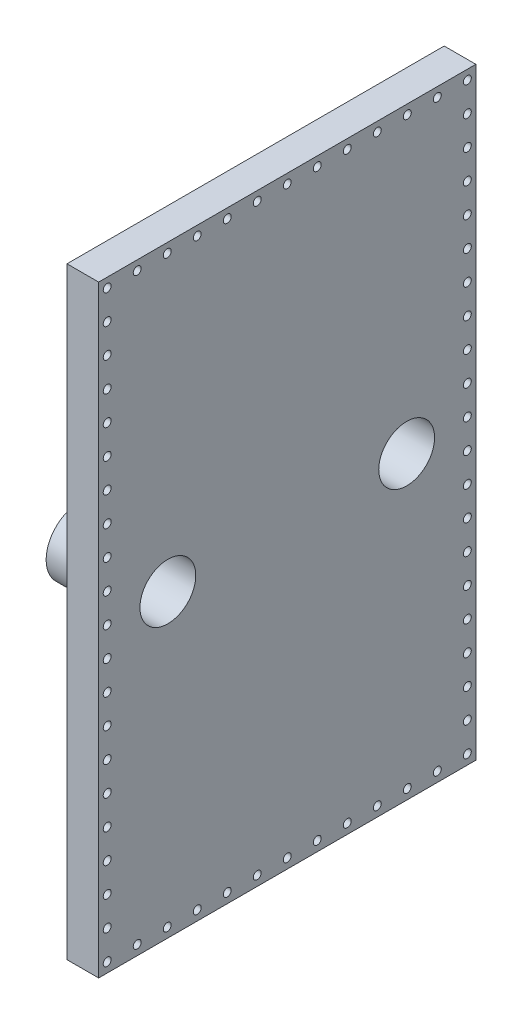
from build123d import *

# Parameters (mm, degrees)
CROQUIS1_W              = 1191.5
CROQUIS1_H              = 723
CROQUIS1_W_2            = 1115.5
CROQUIS1_H_2            = 647
SALIENTE_EXTRUIR1_DEPTH = 452.5
CROQUIS7_R              = 40
SALIENTE_EXTRUIR3_DEPTH = 68
CROQUIS8_R              = 33.5
CORTAR_EXTRUIR1_DEPTH   = 106
CROQUIS9_R              = 19
CROQUIS9_R_2            = 14.35
CORTAR_EXTRUIR2_DEPTH   = 38
CROQUIS15_W             = 38
CROQUIS15_H             = 647
SALIENTE_EXTRUIR4_DEPTH = 40
CROQUIS16_W             = 38
CROQUIS16_H             = 647
SALIENTE_EXTRUIR5_DEPTH = 40
CROQUIS14_R             = 4.7625
CORTAR_EXTRUIR3_DEPTH   = 70
CORTAR_EXTRUIR4_REACH   = 1467.318
CROQUIS17_W             = 1153.5
CROQUIS17_H             = 723


with BuildPart() as part:
    # Croquis1 → Saliente-Extruir1 (new body)
    with BuildSketch(Plane.XY):
        with Locations((595.75, 361.5)):
            Rectangle(CROQUIS1_W, CROQUIS1_H)
        with Locations((595.75, 361.5)):
            Rectangle(CROQUIS1_W_2, CROQUIS1_H_2, mode=Mode.SUBTRACT)
    extrude(amount=SALIENTE_EXTRUIR1_DEPTH)

    # Croquis7 → Saliente-Extruir3 (add)
    with BuildSketch(Plane.ZY):
        with Locations(Location((83, 360, 0), (0, 0, 180))):
            Circle(CROQUIS7_R)
        with Locations(Location((369.5, 360, 0), (0, 0, 180))):
            Circle(CROQUIS7_R)
    extrude(amount=SALIENTE_EXTRUIR3_DEPTH)

    # Croquis8 → Cortar-Extruir1 (cut)
    with BuildSketch(Plane.ZY.offset(68)):
        with Locations((83, 360)):
            Circle(CROQUIS8_R)
        with Locations((369.5, 360)):
            Circle(CROQUIS8_R)
    extrude(amount=-CORTAR_EXTRUIR1_DEPTH, mode=Mode.SUBTRACT)

    # Croquis9 → Cortar-Extruir2 (cut)
    with BuildSketch(Plane(origin=(1191.5, 0, 0), x_dir=(0, 0, -1), z_dir=(1, 0, 0))):
        with Locations((-264.5, 101.5)):
            Circle(CROQUIS9_R)
        with Locations((-182, 624.5)):
            Circle(CROQUIS9_R_2)
    extrude(amount=-CORTAR_EXTRUIR2_DEPTH, mode=Mode.SUBTRACT)

    # Croquis15 → Saliente-Extruir4 (add)
    with BuildSketch(Plane.XY.offset(452.5)):
        with Locations((57, 361.5)):
            Rectangle(CROQUIS15_W, CROQUIS15_H)
    extrude(amount=-SALIENTE_EXTRUIR4_DEPTH)

    # Croquis16 → Saliente-Extruir5 (add)
    with BuildSketch(Plane(origin=(0, 0, 0), x_dir=(-1, 0, 0), z_dir=(0, 0, -1))):
        with Locations((-57, 361.5)):
            Rectangle(CROQUIS16_W, CROQUIS16_H)
    extrude(amount=-SALIENTE_EXTRUIR5_DEPTH)

    # Croquis14 → Cortar-Extruir3 (cut)
    with BuildSketch(Plane.ZY):
        with Locations((10.25, 711.75)):
            Circle(CROQUIS14_R)
        with Locations((46.25, 711.75)):
            Circle(CROQUIS14_R)
        with Locations((82.25, 711.75)):
            Circle(CROQUIS14_R)
        with Locations((118.25, 711.75)):
            Circle(CROQUIS14_R)
        with Locations((154.25, 711.75)):
            Circle(CROQUIS14_R)
        with Locations((190.25, 711.75)):
            Circle(CROQUIS14_R)
        with Locations((226.25, 711.75)):
            Circle(CROQUIS14_R)
        with Locations((262.25, 711.75)):
            Circle(CROQUIS14_R)
        with Locations((298.25, 711.75)):
            Circle(CROQUIS14_R)
        with Locations((334.25, 711.75)):
            Circle(CROQUIS14_R)
        with Locations((370.25, 711.75)):
            Circle(CROQUIS14_R)
        with Locations((406.25, 711.75)):
            Circle(CROQUIS14_R)
        with Locations((442.25, 711.75)):
            Circle(CROQUIS14_R)
        with Locations((10.25, 676.75)):
            Circle(CROQUIS14_R)
        with Locations((10.25, 641.75)):
            Circle(CROQUIS14_R)
        with Locations((10.25, 606.75)):
            Circle(CROQUIS14_R)
        with Locations((10.25, 571.75)):
            Circle(CROQUIS14_R)
        with Locations((10.25, 536.75)):
            Circle(CROQUIS14_R)
        with Locations((10.25, 501.75)):
            Circle(CROQUIS14_R)
        with Locations((10.25, 466.75)):
            Circle(CROQUIS14_R)
        with Locations((10.25, 431.75)):
            Circle(CROQUIS14_R)
        with Locations((10.25, 396.75)):
            Circle(CROQUIS14_R)
        with Locations((10.25, 361.75)):
            Circle(CROQUIS14_R)
        with Locations((10.25, 326.75)):
            Circle(CROQUIS14_R)
        with Locations((10.25, 291.75)):
            Circle(CROQUIS14_R)
        with Locations((10.25, 256.75)):
            Circle(CROQUIS14_R)
        with Locations((10.25, 221.75)):
            Circle(CROQUIS14_R)
        with Locations((10.25, 186.75)):
            Circle(CROQUIS14_R)
        with Locations((10.25, 151.75)):
            Circle(CROQUIS14_R)
        with Locations((10.25, 116.75)):
            Circle(CROQUIS14_R)
        with Locations((10.25, 81.75)):
            Circle(CROQUIS14_R)
        with Locations((10.25, 46.75)):
            Circle(CROQUIS14_R)
        with Locations((10.25, 11.75)):
            Circle(CROQUIS14_R)
        with Locations((46.25, 11.75)):
            Circle(CROQUIS14_R)
        with Locations((82.25, 11.75)):
            Circle(CROQUIS14_R)
        with Locations((118.25, 11.75)):
            Circle(CROQUIS14_R)
        with Locations((154.25, 11.75)):
            Circle(CROQUIS14_R)
        with Locations((190.25, 11.75)):
            Circle(CROQUIS14_R)
        with Locations((226.25, 11.75)):
            Circle(CROQUIS14_R)
        with Locations((262.25, 11.75)):
            Circle(CROQUIS14_R)
        with Locations((298.25, 11.75)):
            Circle(CROQUIS14_R)
        with Locations((334.25, 11.75)):
            Circle(CROQUIS14_R)
        with Locations((370.25, 11.75)):
            Circle(CROQUIS14_R)
        with Locations((406.25, 11.75)):
            Circle(CROQUIS14_R)
        with Locations((442.25, 11.75)):
            Circle(CROQUIS14_R)
        with Locations((442.25, 46.75)):
            Circle(CROQUIS14_R)
        with Locations((442.25, 81.75)):
            Circle(CROQUIS14_R)
        with Locations((442.25, 116.75)):
            Circle(CROQUIS14_R)
        with Locations((442.25, 151.75)):
            Circle(CROQUIS14_R)
        with Locations((442.25, 186.75)):
            Circle(CROQUIS14_R)
        with Locations((442.25, 221.75)):
            Circle(CROQUIS14_R)
        with Locations((442.25, 256.75)):
            Circle(CROQUIS14_R)
        with Locations((442.25, 291.75)):
            Circle(CROQUIS14_R)
        with Locations((442.25, 326.75)):
            Circle(CROQUIS14_R)
        with Locations((442.25, 361.75)):
            Circle(CROQUIS14_R)
        with Locations((442.25, 396.75)):
            Circle(CROQUIS14_R)
        with Locations((442.25, 431.75)):
            Circle(CROQUIS14_R)
        with Locations((442.25, 466.75)):
            Circle(CROQUIS14_R)
        with Locations((442.25, 501.75)):
            Circle(CROQUIS14_R)
        with Locations((442.25, 536.75)):
            Circle(CROQUIS14_R)
        with Locations((442.25, 571.75)):
            Circle(CROQUIS14_R)
        with Locations((442.25, 606.75)):
            Circle(CROQUIS14_R)
        with Locations((442.25, 641.75)):
            Circle(CROQUIS14_R)
        with Locations((442.25, 676.75)):
            Circle(CROQUIS14_R)
    extrude(amount=-CORTAR_EXTRUIR3_DEPTH, mode=Mode.SUBTRACT)

    # Croquis17 → Cortar-Extruir4 (cut, up to next)
    with BuildSketch(Plane.XY.offset(452.5), mode=Mode.PRIVATE) as cortar_extruir4_sk1:
        with Locations((614.75, 361.5)):
            Rectangle(CROQUIS17_W, CROQUIS17_H)
    cortar_extruir4_tool1 = extrude(cortar_extruir4_sk1.sketch, amount=-CORTAR_EXTRUIR4_REACH, mode=Mode.PRIVATE) & part.part
    add(cortar_extruir4_tool1.solids().sort_by_distance((614.75, 361.5, 452.5))[0], mode=Mode.SUBTRACT)


solid = part.part
